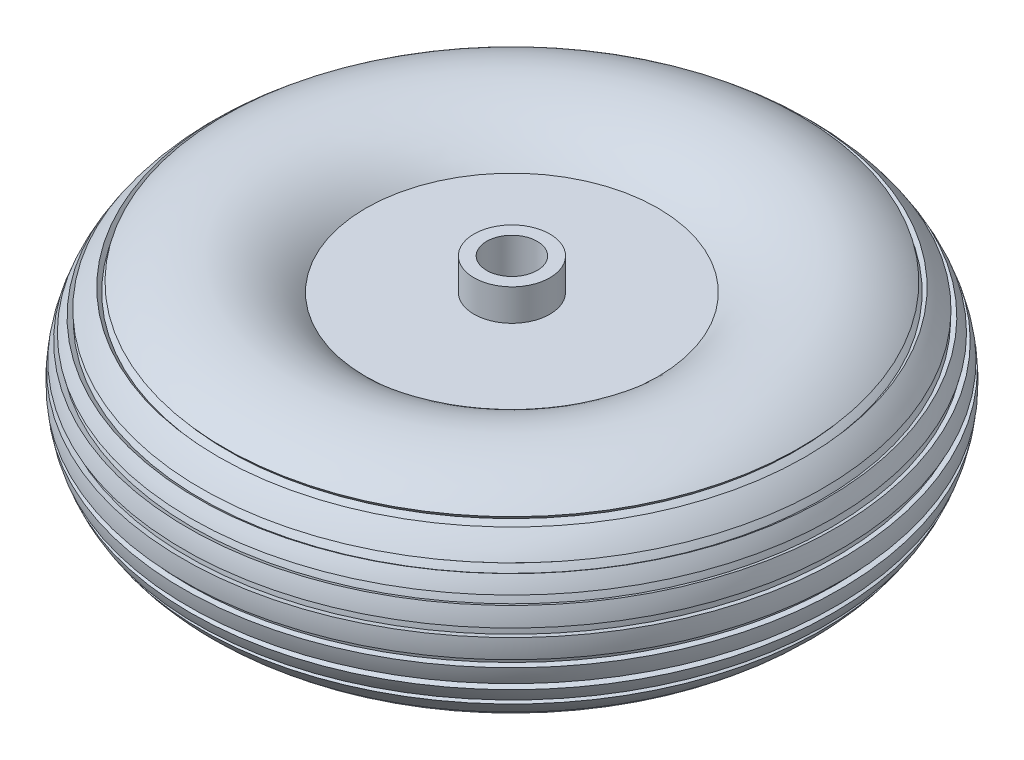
ISO-10303-21;
HEADER;
FILE_DESCRIPTION(('STEP AP214'),'2;1');
FILE_NAME('part.step','',(''),(''),'','','');
FILE_SCHEMA(('AUTOMOTIVE_DESIGN { 1 0 10303 214 1 1 1 1 }'));
ENDSEC;
DATA;
#1=APPLICATION_CONTEXT('core data for automotive mechanical design processes');
#2=APPLICATION_PROTOCOL_DEFINITION('international standard','automotive_design',2000,#1);
#3=PRODUCT_CONTEXT('',#1,'mechanical');
#4=PRODUCT('Part','Part','',(#3));
#5=PRODUCT_RELATED_PRODUCT_CATEGORY('part','',(#4));
#6=PRODUCT_DEFINITION_FORMATION('','',#4);
#7=PRODUCT_DEFINITION_CONTEXT('part definition',#1,'design');
#8=PRODUCT_DEFINITION('design','',#6,#7);
#9=PRODUCT_DEFINITION_SHAPE('','',#8);
#10=(LENGTH_UNIT() NAMED_UNIT(*) SI_UNIT(.MILLI.,.METRE.));
#11=(NAMED_UNIT(*) PLANE_ANGLE_UNIT() SI_UNIT($,.RADIAN.));
#12=(NAMED_UNIT(*) SI_UNIT($,.STERADIAN.) SOLID_ANGLE_UNIT());
#13=UNCERTAINTY_MEASURE_WITH_UNIT(LENGTH_MEASURE(1.E-05),#10,'distance_accuracy_value','');
#14=(GEOMETRIC_REPRESENTATION_CONTEXT(3) GLOBAL_UNCERTAINTY_ASSIGNED_CONTEXT((#13)) GLOBAL_UNIT_ASSIGNED_CONTEXT((#10,
#11,#12)) REPRESENTATION_CONTEXT('',''));
#15=CARTESIAN_POINT('',(0.,0.,0.));
#16=DIRECTION('',(0.,0.,1.));
#17=DIRECTION('',(1.,0.,0.));
#18=AXIS2_PLACEMENT_3D('',#15,#16,#17);
#19=CARTESIAN_POINT('',(0.,30.,0.));
#20=DIRECTION('',(0.,1.,0.));
#21=DIRECTION('',(0.,0.,1.));
#22=AXIS2_PLACEMENT_3D('',#19,#20,#21);
#23=PLANE('',#22);
#24=CARTESIAN_POINT('',(0.,30.,-65.1760171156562));
#25=DIRECTION('',(0.,-1.,0.));
#26=DIRECTION('',(0.,0.,-1.));
#27=AXIS2_PLACEMENT_3D('',#24,#25,#26);
#28=CIRCLE('',#27,57.7480477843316);
#29=CARTESIAN_POINT('',(0.,30.,-122.924064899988));
#30=VERTEX_POINT('',#29);
#31=EDGE_CURVE('E177',#30,#30,#28,.T.);
#32=ORIENTED_EDGE('',*,*,#31,.F.);
#33=EDGE_LOOP('',(#32));
#34=FACE_BOUND('',#33,.T.);
#35=CARTESIAN_POINT('',(0.,30.,-65.1760171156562));
#36=DIRECTION('',(0.,1.,0.));
#37=DIRECTION('',(0.,0.,1.));
#38=AXIS2_PLACEMENT_3D('',#35,#36,#37);
#39=CIRCLE('',#38,15.);
#40=CARTESIAN_POINT('',(0.,30.,-50.1760171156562));
#41=VERTEX_POINT('',#40);
#42=EDGE_CURVE('E202',#41,#41,#39,.T.);
#43=ORIENTED_EDGE('',*,*,#42,.F.);
#44=EDGE_LOOP('',(#43));
#45=FACE_BOUND('',#44,.T.);
#46=ADVANCED_FACE('F45',(#34,#45),#23,.T.);
#47=CARTESIAN_POINT('',(0.,-30.,0.));
#48=DIRECTION('',(0.,1.,0.));
#49=DIRECTION('',(0.,0.,1.));
#50=AXIS2_PLACEMENT_3D('',#47,#48,#49);
#51=PLANE('',#50);
#52=CARTESIAN_POINT('',(0.,-30.,-65.1760171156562));
#53=DIRECTION('',(0.,-1.,0.));
#54=DIRECTION('',(0.,0.,-1.));
#55=AXIS2_PLACEMENT_3D('',#52,#53,#54);
#56=CIRCLE('',#55,57.7480477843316);
#57=CARTESIAN_POINT('',(0.,-30.,-122.924064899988));
#58=VERTEX_POINT('',#57);
#59=EDGE_CURVE('E173',#58,#58,#56,.T.);
#60=ORIENTED_EDGE('',*,*,#59,.T.);
#61=EDGE_LOOP('',(#60));
#62=FACE_BOUND('',#61,.T.);
#63=CARTESIAN_POINT('',(0.,-30.,-65.1760171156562));
#64=DIRECTION('',(0.,1.,0.));
#65=DIRECTION('',(0.,0.,1.));
#66=AXIS2_PLACEMENT_3D('',#63,#64,#65);
#67=CIRCLE('',#66,15.);
#68=CARTESIAN_POINT('',(0.,-30.,-50.1760171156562));
#69=VERTEX_POINT('',#68);
#70=EDGE_CURVE('E10',#69,#69,#67,.F.);
#71=ORIENTED_EDGE('',*,*,#70,.F.);
#72=EDGE_LOOP('',(#71));
#73=FACE_BOUND('',#72,.T.);
#74=ADVANCED_FACE('F233',(#62,#73),#51,.F.);
#75=CARTESIAN_POINT('',(0.,30.1684176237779,-65.1760171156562));
#76=DIRECTION('',(0.,1.,0.));
#77=DIRECTION('',(0.,0.,1.));
#78=AXIS2_PLACEMENT_3D('',#75,#76,#77);
#79=CONICAL_SURFACE('',#78,114.733442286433,0.727845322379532);
#80=CARTESIAN_POINT('',(0.,31.7309063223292,-65.1760171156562));
#81=DIRECTION('',(0.,-1.,0.));
#82=DIRECTION('',(0.,0.,-1.));
#83=AXIS2_PLACEMENT_3D('',#80,#81,#82);
#84=CIRCLE('',#83,116.125689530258);
#85=CARTESIAN_POINT('',(0.,31.7309063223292,-181.301706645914));
#86=VERTEX_POINT('',#85);
#87=EDGE_CURVE('E53',#86,#86,#84,.T.);
#88=ORIENTED_EDGE('',*,*,#87,.F.);
#89=EDGE_LOOP('',(#88));
#90=FACE_BOUND('',#89,.T.);
#91=CARTESIAN_POINT('',(0.,30.1684176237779,-65.1760171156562));
#92=DIRECTION('',(0.,-1.,0.));
#93=DIRECTION('',(0.,0.,-1.));
#94=AXIS2_PLACEMENT_3D('',#91,#92,#93);
#95=CIRCLE('',#94,114.733442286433);
#96=CARTESIAN_POINT('',(0.,30.1684176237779,-179.909459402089));
#97=VERTEX_POINT('',#96);
#98=EDGE_CURVE('E189',#97,#97,#95,.T.);
#99=ORIENTED_EDGE('',*,*,#98,.T.);
#100=EDGE_LOOP('',(#99));
#101=FACE_BOUND('',#100,.T.);
#102=ADVANCED_FACE('F47',(#90,#101),#79,.F.);
#103=CARTESIAN_POINT('',(0.,0.,-65.1760171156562));
#104=DIRECTION('',(0.,-1.,0.));
#105=DIRECTION('',(0.,0.,-1.));
#106=AXIS2_PLACEMENT_3D('',#103,#104,#105);
#107=TOROIDAL_SURFACE('',#106,87.8520342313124,42.5);
#108=CARTESIAN_POINT('',(0.,24.1701646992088,-65.1760171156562));
#109=DIRECTION('',(0.,-1.,0.));
#110=DIRECTION('',(0.,0.,-1.));
#111=AXIS2_PLACEMENT_3D('',#108,#109,#110);
#112=CIRCLE('',#111,122.80991086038);
#113=CARTESIAN_POINT('',(0.,24.1701646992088,-187.985927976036));
#114=VERTEX_POINT('',#113);
#115=EDGE_CURVE('E58',#114,#114,#112,.T.);
#116=ORIENTED_EDGE('',*,*,#115,.F.);
#117=EDGE_LOOP('',(#116));
#118=FACE_BOUND('',#117,.T.);
#119=ORIENTED_EDGE('',*,*,#87,.T.);
#120=EDGE_LOOP('',(#119));
#121=FACE_BOUND('',#120,.T.);
#122=ADVANCED_FACE('F359',(#118,#121),#107,.T.);
#123=CARTESIAN_POINT('',(0.,22.9799809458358,-65.1760171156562));
#124=DIRECTION('',(0.,1.,0.));
#125=DIRECTION('',(0.,0.,1.));
#126=AXIS2_PLACEMENT_3D('',#123,#124,#125);
#127=CONICAL_SURFACE('',#126,121.088520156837,0.965859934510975);
#128=ORIENTED_EDGE('',*,*,#115,.T.);
#129=EDGE_LOOP('',(#128));
#130=FACE_BOUND('',#129,.T.);
#131=CARTESIAN_POINT('',(0.,22.9799809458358,-65.1760171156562));
#132=DIRECTION('',(0.,-1.,0.));
#133=DIRECTION('',(0.,0.,-1.));
#134=AXIS2_PLACEMENT_3D('',#131,#132,#133);
#135=CIRCLE('',#134,121.088520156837);
#136=CARTESIAN_POINT('',(0.,22.9799809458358,-186.264537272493));
#137=VERTEX_POINT('',#136);
#138=EDGE_CURVE('E63',#137,#137,#135,.T.);
#139=ORIENTED_EDGE('',*,*,#138,.F.);
#140=EDGE_LOOP('',(#139));
#141=FACE_BOUND('',#140,.T.);
#142=ADVANCED_FACE('F356',(#130,#141),#127,.T.);
#143=CARTESIAN_POINT('',(0.,0.,-65.1760171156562));
#144=DIRECTION('',(0.,-1.,0.));
#145=DIRECTION('',(0.,0.,-1.));
#146=AXIS2_PLACEMENT_3D('',#143,#144,#145);
#147=TOROIDAL_SURFACE('',#146,87.8520342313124,40.407221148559);
#148=CARTESIAN_POINT('',(0.,20.4806485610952,-65.1760171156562));
#149=DIRECTION('',(0.,-1.,0.));
#150=DIRECTION('',(0.,0.,-1.));
#151=AXIS2_PLACEMENT_3D('',#148,#149,#150);
#152=CIRCLE('',#151,122.684297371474);
#153=CARTESIAN_POINT('',(0.,20.4806485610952,-187.86031448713));
#154=VERTEX_POINT('',#153);
#155=EDGE_CURVE('E69',#154,#154,#152,.T.);
#156=ORIENTED_EDGE('',*,*,#155,.F.);
#157=EDGE_LOOP('',(#156));
#158=FACE_BOUND('',#157,.T.);
#159=ORIENTED_EDGE('',*,*,#138,.T.);
#160=EDGE_LOOP('',(#159));
#161=FACE_BOUND('',#160,.T.);
#162=ADVANCED_FACE('F352',(#158,#161),#147,.T.);
#163=CARTESIAN_POINT('',(0.,21.6438709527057,-65.1760171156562));
#164=DIRECTION('',(0.,1.,0.));
#165=DIRECTION('',(0.,0.,1.));
#166=AXIS2_PLACEMENT_3D('',#163,#164,#165);
#167=CONICAL_SURFACE('',#166,124.427884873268,0.982463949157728);
#168=ORIENTED_EDGE('',*,*,#155,.T.);
#169=EDGE_LOOP('',(#168));
#170=FACE_BOUND('',#169,.T.);
#171=CARTESIAN_POINT('',(0.,21.6438709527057,-65.1760171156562));
#172=DIRECTION('',(0.,-1.,0.));
#173=DIRECTION('',(0.,0.,-1.));
#174=AXIS2_PLACEMENT_3D('',#171,#172,#173);
#175=CIRCLE('',#174,124.427884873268);
#176=CARTESIAN_POINT('',(0.,21.6438709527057,-189.603901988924));
#177=VERTEX_POINT('',#176);
#178=EDGE_CURVE('E73',#177,#177,#175,.T.);
#179=ORIENTED_EDGE('',*,*,#178,.F.);
#180=EDGE_LOOP('',(#179));
#181=FACE_BOUND('',#180,.T.);
#182=ADVANCED_FACE('F348',(#170,#181),#167,.F.);
#183=CARTESIAN_POINT('',(0.,0.,-65.1760171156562));
#184=DIRECTION('',(0.,-1.,0.));
#185=DIRECTION('',(0.,0.,-1.));
#186=AXIS2_PLACEMENT_3D('',#183,#184,#185);
#187=TOROIDAL_SURFACE('',#186,87.8520342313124,42.5);
#188=CARTESIAN_POINT('',(0.,16.204262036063,-65.1760171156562));
#189=DIRECTION('',(0.,-1.,0.));
#190=DIRECTION('',(0.,0.,-1.));
#191=AXIS2_PLACEMENT_3D('',#188,#189,#190);
#192=CIRCLE('',#191,127.141624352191);
#193=CARTESIAN_POINT('',(0.,16.204262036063,-192.317641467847));
#194=VERTEX_POINT('',#193);
#195=EDGE_CURVE('E77',#194,#194,#192,.T.);
#196=ORIENTED_EDGE('',*,*,#195,.F.);
#197=EDGE_LOOP('',(#196));
#198=FACE_BOUND('',#197,.T.);
#199=ORIENTED_EDGE('',*,*,#178,.T.);
#200=EDGE_LOOP('',(#199));
#201=FACE_BOUND('',#200,.T.);
#202=ADVANCED_FACE('F344',(#198,#201),#187,.T.);
#203=CARTESIAN_POINT('',(0.,15.4063341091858,-65.1760171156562));
#204=DIRECTION('',(0.,1.,0.));
#205=DIRECTION('',(0.,0.,1.));
#206=AXIS2_PLACEMENT_3D('',#203,#204,#205);
#207=CONICAL_SURFACE('',#206,125.206932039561,1.17961934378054);
#208=ORIENTED_EDGE('',*,*,#195,.T.);
#209=EDGE_LOOP('',(#208));
#210=FACE_BOUND('',#209,.T.);
#211=CARTESIAN_POINT('',(0.,15.4063341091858,-65.1760171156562));
#212=DIRECTION('',(0.,-1.,0.));
#213=DIRECTION('',(0.,0.,-1.));
#214=AXIS2_PLACEMENT_3D('',#211,#212,#213);
#215=CIRCLE('',#214,125.206932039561);
#216=CARTESIAN_POINT('',(0.,15.4063341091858,-190.382949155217));
#217=VERTEX_POINT('',#216);
#218=EDGE_CURVE('E81',#217,#217,#215,.T.);
#219=ORIENTED_EDGE('',*,*,#218,.F.);
#220=EDGE_LOOP('',(#219));
#221=FACE_BOUND('',#220,.T.);
#222=ADVANCED_FACE('F340',(#210,#221),#207,.T.);
#223=CARTESIAN_POINT('',(0.,0.,-65.1760171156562));
#224=DIRECTION('',(0.,-1.,0.));
#225=DIRECTION('',(0.,0.,-1.));
#226=AXIS2_PLACEMENT_3D('',#223,#224,#225);
#227=TOROIDAL_SURFACE('',#226,87.8520342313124,40.407221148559);
#228=CARTESIAN_POINT('',(0.,12.592212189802,-65.1760171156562));
#229=DIRECTION('',(0.,-1.,0.));
#230=DIRECTION('',(0.,0.,-1.));
#231=AXIS2_PLACEMENT_3D('',#228,#229,#230);
#232=CIRCLE('',#231,126.247082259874);
#233=CARTESIAN_POINT('',(0.,12.592212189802,-191.42309937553));
#234=VERTEX_POINT('',#233);
#235=EDGE_CURVE('E85',#234,#234,#232,.T.);
#236=ORIENTED_EDGE('',*,*,#235,.F.);
#237=EDGE_LOOP('',(#236));
#238=FACE_BOUND('',#237,.T.);
#239=ORIENTED_EDGE('',*,*,#218,.T.);
#240=EDGE_LOOP('',(#239));
#241=FACE_BOUND('',#240,.T.);
#242=ADVANCED_FACE('F336',(#238,#241),#227,.T.);
#243=CARTESIAN_POINT('',(0.,13.3922366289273,-65.1760171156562));
#244=DIRECTION('',(0.,1.,0.));
#245=DIRECTION('',(0.,0.,1.));
#246=AXIS2_PLACEMENT_3D('',#243,#244,#245);
#247=CONICAL_SURFACE('',#246,128.186857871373,1.1796193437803);
#248=ORIENTED_EDGE('',*,*,#235,.T.);
#249=EDGE_LOOP('',(#248));
#250=FACE_BOUND('',#249,.T.);
#251=CARTESIAN_POINT('',(0.,13.3922366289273,-65.1760171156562));
#252=DIRECTION('',(0.,-1.,0.));
#253=DIRECTION('',(0.,0.,-1.));
#254=AXIS2_PLACEMENT_3D('',#251,#252,#253);
#255=CIRCLE('',#254,128.186857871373);
#256=CARTESIAN_POINT('',(0.,13.3922366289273,-193.362874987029));
#257=VERTEX_POINT('',#256);
#258=EDGE_CURVE('E89',#257,#257,#255,.T.);
#259=ORIENTED_EDGE('',*,*,#258,.F.);
#260=EDGE_LOOP('',(#259));
#261=FACE_BOUND('',#260,.T.);
#262=ADVANCED_FACE('F332',(#250,#261),#247,.F.);
#263=CARTESIAN_POINT('',(0.,0.,-65.1760171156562));
#264=DIRECTION('',(0.,-1.,0.));
#265=DIRECTION('',(0.,0.,-1.));
#266=AXIS2_PLACEMENT_3D('',#263,#264,#265);
#267=TOROIDAL_SURFACE('',#266,87.8520342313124,42.5);
#268=CARTESIAN_POINT('',(0.,6.79895962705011,-65.1760171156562));
#269=DIRECTION('',(0.,-1.,0.));
#270=DIRECTION('',(0.,0.,-1.));
#271=AXIS2_PLACEMENT_3D('',#268,#269,#270);
#272=CIRCLE('',#271,129.804675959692);
#273=CARTESIAN_POINT('',(0.,6.79895962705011,-194.980693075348));
#274=VERTEX_POINT('',#273);
#275=EDGE_CURVE('E93',#274,#274,#272,.T.);
#276=ORIENTED_EDGE('',*,*,#275,.F.);
#277=EDGE_LOOP('',(#276));
#278=FACE_BOUND('',#277,.T.);
#279=ORIENTED_EDGE('',*,*,#258,.T.);
#280=EDGE_LOOP('',(#279));
#281=FACE_BOUND('',#280,.T.);
#282=ADVANCED_FACE('F328',(#278,#281),#267,.T.);
#283=CARTESIAN_POINT('',(0.,6.46416624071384,-65.1760171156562));
#284=DIRECTION('',(0.,1.,0.));
#285=DIRECTION('',(0.,0.,1.));
#286=AXIS2_PLACEMENT_3D('',#283,#284,#285);
#287=CONICAL_SURFACE('',#286,127.738850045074,1.41013047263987);
#288=ORIENTED_EDGE('',*,*,#275,.T.);
#289=EDGE_LOOP('',(#288));
#290=FACE_BOUND('',#289,.T.);
#291=CARTESIAN_POINT('',(0.,6.46416624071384,-65.1760171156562));
#292=DIRECTION('',(0.,-1.,0.));
#293=DIRECTION('',(0.,0.,-1.));
#294=AXIS2_PLACEMENT_3D('',#291,#292,#293);
#295=CIRCLE('',#294,127.738850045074);
#296=CARTESIAN_POINT('',(0.,6.46416624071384,-192.91486716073));
#297=VERTEX_POINT('',#296);
#298=EDGE_CURVE('E97',#297,#297,#295,.T.);
#299=ORIENTED_EDGE('',*,*,#298,.F.);
#300=EDGE_LOOP('',(#299));
#301=FACE_BOUND('',#300,.T.);
#302=ADVANCED_FACE('F324',(#290,#301),#287,.T.);
#303=CARTESIAN_POINT('',(0.,0.,-65.1760171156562));
#304=DIRECTION('',(0.,-1.,0.));
#305=DIRECTION('',(0.,0.,-1.));
#306=AXIS2_PLACEMENT_3D('',#303,#304,#305);
#307=TOROIDAL_SURFACE('',#306,87.8520342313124,40.407221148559);
#308=CARTESIAN_POINT('',(0.,3.46797674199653,-65.1760171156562));
#309=DIRECTION('',(0.,-1.,0.));
#310=DIRECTION('',(0.,0.,-1.));
#311=AXIS2_PLACEMENT_3D('',#308,#309,#310);
#312=CIRCLE('',#311,128.110159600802);
#313=CARTESIAN_POINT('',(0.,3.46797674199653,-193.286176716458));
#314=VERTEX_POINT('',#313);
#315=EDGE_CURVE('E101',#314,#314,#312,.T.);
#316=ORIENTED_EDGE('',*,*,#315,.F.);
#317=EDGE_LOOP('',(#316));
#318=FACE_BOUND('',#317,.T.);
#319=ORIENTED_EDGE('',*,*,#298,.T.);
#320=EDGE_LOOP('',(#319));
#321=FACE_BOUND('',#320,.T.);
#322=ADVANCED_FACE('F320',(#318,#321),#307,.T.);
#323=CARTESIAN_POINT('',(0.,3.79895962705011,-65.1760171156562));
#324=DIRECTION('',(0.,1.,0.));
#325=DIRECTION('',(0.,0.,1.));
#326=AXIS2_PLACEMENT_3D('',#323,#324,#325);
#327=CONICAL_SURFACE('',#326,130.181904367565,1.41237463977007);
#328=ORIENTED_EDGE('',*,*,#315,.T.);
#329=EDGE_LOOP('',(#328));
#330=FACE_BOUND('',#329,.T.);
#331=CARTESIAN_POINT('',(0.,3.79895962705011,-65.1760171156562));
#332=DIRECTION('',(0.,-1.,0.));
#333=DIRECTION('',(0.,0.,-1.));
#334=AXIS2_PLACEMENT_3D('',#331,#332,#333);
#335=CIRCLE('',#334,130.181904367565);
#336=CARTESIAN_POINT('',(0.,3.79895962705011,-195.357921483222));
#337=VERTEX_POINT('',#336);
#338=EDGE_CURVE('E105',#337,#337,#335,.T.);
#339=ORIENTED_EDGE('',*,*,#338,.F.);
#340=EDGE_LOOP('',(#339));
#341=FACE_BOUND('',#340,.T.);
#342=ADVANCED_FACE('F316',(#330,#341),#327,.F.);
#343=CARTESIAN_POINT('',(0.,0.,-65.1760171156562));
#344=DIRECTION('',(0.,-1.,0.));
#345=DIRECTION('',(0.,0.,-1.));
#346=AXIS2_PLACEMENT_3D('',#343,#344,#345);
#347=TOROIDAL_SURFACE('',#346,87.8520342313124,42.5);
#348=CARTESIAN_POINT('',(0.,-3.79895962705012,-65.1760171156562));
#349=DIRECTION('',(0.,-1.,0.));
#350=DIRECTION('',(0.,0.,-1.));
#351=AXIS2_PLACEMENT_3D('',#348,#349,#350);
#352=CIRCLE('',#351,130.181904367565);
#353=CARTESIAN_POINT('',(0.,-3.79895962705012,-195.357921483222));
#354=VERTEX_POINT('',#353);
#355=EDGE_CURVE('E109',#354,#354,#352,.T.);
#356=ORIENTED_EDGE('',*,*,#355,.F.);
#357=EDGE_LOOP('',(#356));
#358=FACE_BOUND('',#357,.T.);
#359=ORIENTED_EDGE('',*,*,#338,.T.);
#360=EDGE_LOOP('',(#359));
#361=FACE_BOUND('',#360,.T.);
#362=ADVANCED_FACE('F312',(#358,#361),#347,.T.);
#363=CARTESIAN_POINT('',(0.,-3.79895962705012,-65.1760171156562));
#364=DIRECTION('',(0.,-1.,0.));
#365=DIRECTION('',(0.,0.,-1.));
#366=AXIS2_PLACEMENT_3D('',#363,#364,#365);
#367=CONICAL_SURFACE('',#366,130.181904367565,1.41237463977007);
#368=CARTESIAN_POINT('',(0.,-3.46797674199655,-65.1760171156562));
#369=DIRECTION('',(0.,-1.,0.));
#370=DIRECTION('',(0.,0.,-1.));
#371=AXIS2_PLACEMENT_3D('',#368,#369,#370);
#372=CIRCLE('',#371,128.110159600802);
#373=CARTESIAN_POINT('',(0.,-3.46797674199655,-193.286176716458));
#374=VERTEX_POINT('',#373);
#375=EDGE_CURVE('E113',#374,#374,#372,.T.);
#376=ORIENTED_EDGE('',*,*,#375,.F.);
#377=EDGE_LOOP('',(#376));
#378=FACE_BOUND('',#377,.T.);
#379=ORIENTED_EDGE('',*,*,#355,.T.);
#380=EDGE_LOOP('',(#379));
#381=FACE_BOUND('',#380,.T.);
#382=ADVANCED_FACE('F308',(#378,#381),#367,.F.);
#383=CARTESIAN_POINT('',(0.,0.,-65.1760171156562));
#384=DIRECTION('',(0.,-1.,0.));
#385=DIRECTION('',(0.,0.,-1.));
#386=AXIS2_PLACEMENT_3D('',#383,#384,#385);
#387=TOROIDAL_SURFACE('',#386,87.8520342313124,40.407221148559);
#388=ORIENTED_EDGE('',*,*,#375,.T.);
#389=EDGE_LOOP('',(#388));
#390=FACE_BOUND('',#389,.T.);
#391=CARTESIAN_POINT('',(0.,-6.46416624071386,-65.1760171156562));
#392=DIRECTION('',(0.,-1.,0.));
#393=DIRECTION('',(0.,0.,-1.));
#394=AXIS2_PLACEMENT_3D('',#391,#392,#393);
#395=CIRCLE('',#394,127.738850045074);
#396=CARTESIAN_POINT('',(0.,-6.46416624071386,-192.91486716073));
#397=VERTEX_POINT('',#396);
#398=EDGE_CURVE('E117',#397,#397,#395,.T.);
#399=ORIENTED_EDGE('',*,*,#398,.F.);
#400=EDGE_LOOP('',(#399));
#401=FACE_BOUND('',#400,.T.);
#402=ADVANCED_FACE('F304',(#390,#401),#387,.T.);
#403=CARTESIAN_POINT('',(0.,-6.46416624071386,-65.1760171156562));
#404=DIRECTION('',(0.,-1.,0.));
#405=DIRECTION('',(0.,0.,-1.));
#406=AXIS2_PLACEMENT_3D('',#403,#404,#405);
#407=CONICAL_SURFACE('',#406,127.738850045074,1.41013047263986);
#408=CARTESIAN_POINT('',(0.,-6.79895962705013,-65.1760171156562));
#409=DIRECTION('',(0.,-1.,0.));
#410=DIRECTION('',(0.,0.,-1.));
#411=AXIS2_PLACEMENT_3D('',#408,#409,#410);
#412=CIRCLE('',#411,129.804675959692);
#413=CARTESIAN_POINT('',(0.,-6.79895962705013,-194.980693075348));
#414=VERTEX_POINT('',#413);
#415=EDGE_CURVE('E121',#414,#414,#412,.T.);
#416=ORIENTED_EDGE('',*,*,#415,.F.);
#417=EDGE_LOOP('',(#416));
#418=FACE_BOUND('',#417,.T.);
#419=ORIENTED_EDGE('',*,*,#398,.T.);
#420=EDGE_LOOP('',(#419));
#421=FACE_BOUND('',#420,.T.);
#422=ADVANCED_FACE('F300',(#418,#421),#407,.T.);
#423=CARTESIAN_POINT('',(0.,0.,-65.1760171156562));
#424=DIRECTION('',(0.,-1.,0.));
#425=DIRECTION('',(0.,0.,-1.));
#426=AXIS2_PLACEMENT_3D('',#423,#424,#425);
#427=TOROIDAL_SURFACE('',#426,87.8520342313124,42.5);
#428=CARTESIAN_POINT('',(0.,-13.3922366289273,-65.1760171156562));
#429=DIRECTION('',(0.,-1.,0.));
#430=DIRECTION('',(0.,0.,-1.));
#431=AXIS2_PLACEMENT_3D('',#428,#429,#430);
#432=CIRCLE('',#431,128.186857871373);
#433=CARTESIAN_POINT('',(0.,-13.3922366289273,-193.362874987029));
#434=VERTEX_POINT('',#433);
#435=EDGE_CURVE('E125',#434,#434,#432,.T.);
#436=ORIENTED_EDGE('',*,*,#435,.F.);
#437=EDGE_LOOP('',(#436));
#438=FACE_BOUND('',#437,.T.);
#439=ORIENTED_EDGE('',*,*,#415,.T.);
#440=EDGE_LOOP('',(#439));
#441=FACE_BOUND('',#440,.T.);
#442=ADVANCED_FACE('F296',(#438,#441),#427,.T.);
#443=CARTESIAN_POINT('',(0.,-13.3922366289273,-65.1760171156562));
#444=DIRECTION('',(0.,-1.,0.));
#445=DIRECTION('',(0.,0.,-1.));
#446=AXIS2_PLACEMENT_3D('',#443,#444,#445);
#447=CONICAL_SURFACE('',#446,128.186857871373,1.17961934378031);
#448=CARTESIAN_POINT('',(0.,-12.592212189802,-65.1760171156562));
#449=DIRECTION('',(0.,-1.,0.));
#450=DIRECTION('',(0.,0.,-1.));
#451=AXIS2_PLACEMENT_3D('',#448,#449,#450);
#452=CIRCLE('',#451,126.247082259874);
#453=CARTESIAN_POINT('',(0.,-12.592212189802,-191.42309937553));
#454=VERTEX_POINT('',#453);
#455=EDGE_CURVE('E129',#454,#454,#452,.T.);
#456=ORIENTED_EDGE('',*,*,#455,.F.);
#457=EDGE_LOOP('',(#456));
#458=FACE_BOUND('',#457,.T.);
#459=ORIENTED_EDGE('',*,*,#435,.T.);
#460=EDGE_LOOP('',(#459));
#461=FACE_BOUND('',#460,.T.);
#462=ADVANCED_FACE('F292',(#458,#461),#447,.F.);
#463=CARTESIAN_POINT('',(0.,0.,-65.1760171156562));
#464=DIRECTION('',(0.,-1.,0.));
#465=DIRECTION('',(0.,0.,-1.));
#466=AXIS2_PLACEMENT_3D('',#463,#464,#465);
#467=TOROIDAL_SURFACE('',#466,87.8520342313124,40.407221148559);
#468=ORIENTED_EDGE('',*,*,#455,.T.);
#469=EDGE_LOOP('',(#468));
#470=FACE_BOUND('',#469,.T.);
#471=CARTESIAN_POINT('',(0.,-15.4063341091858,-65.1760171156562));
#472=DIRECTION('',(0.,-1.,0.));
#473=DIRECTION('',(0.,0.,-1.));
#474=AXIS2_PLACEMENT_3D('',#471,#472,#473);
#475=CIRCLE('',#474,125.206932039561);
#476=CARTESIAN_POINT('',(0.,-15.4063341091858,-190.382949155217));
#477=VERTEX_POINT('',#476);
#478=EDGE_CURVE('E133',#477,#477,#475,.T.);
#479=ORIENTED_EDGE('',*,*,#478,.F.);
#480=EDGE_LOOP('',(#479));
#481=FACE_BOUND('',#480,.T.);
#482=ADVANCED_FACE('F288',(#470,#481),#467,.T.);
#483=CARTESIAN_POINT('',(0.,-15.4063341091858,-65.1760171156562));
#484=DIRECTION('',(0.,-1.,0.));
#485=DIRECTION('',(0.,0.,-1.));
#486=AXIS2_PLACEMENT_3D('',#483,#484,#485);
#487=CONICAL_SURFACE('',#486,125.206932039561,1.17961934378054);
#488=CARTESIAN_POINT('',(0.,-16.204262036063,-65.1760171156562));
#489=DIRECTION('',(0.,-1.,0.));
#490=DIRECTION('',(0.,0.,-1.));
#491=AXIS2_PLACEMENT_3D('',#488,#489,#490);
#492=CIRCLE('',#491,127.141624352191);
#493=CARTESIAN_POINT('',(0.,-16.204262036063,-192.317641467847));
#494=VERTEX_POINT('',#493);
#495=EDGE_CURVE('E137',#494,#494,#492,.T.);
#496=ORIENTED_EDGE('',*,*,#495,.F.);
#497=EDGE_LOOP('',(#496));
#498=FACE_BOUND('',#497,.T.);
#499=ORIENTED_EDGE('',*,*,#478,.T.);
#500=EDGE_LOOP('',(#499));
#501=FACE_BOUND('',#500,.T.);
#502=ADVANCED_FACE('F284',(#498,#501),#487,.T.);
#503=CARTESIAN_POINT('',(0.,0.,-65.1760171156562));
#504=DIRECTION('',(0.,-1.,0.));
#505=DIRECTION('',(0.,0.,-1.));
#506=AXIS2_PLACEMENT_3D('',#503,#504,#505);
#507=TOROIDAL_SURFACE('',#506,87.8520342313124,42.5);
#508=CARTESIAN_POINT('',(0.,-21.6438709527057,-65.1760171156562));
#509=DIRECTION('',(0.,-1.,0.));
#510=DIRECTION('',(0.,0.,-1.));
#511=AXIS2_PLACEMENT_3D('',#508,#509,#510);
#512=CIRCLE('',#511,124.427884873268);
#513=CARTESIAN_POINT('',(0.,-21.6438709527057,-189.603901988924));
#514=VERTEX_POINT('',#513);
#515=EDGE_CURVE('E141',#514,#514,#512,.T.);
#516=ORIENTED_EDGE('',*,*,#515,.F.);
#517=EDGE_LOOP('',(#516));
#518=FACE_BOUND('',#517,.T.);
#519=ORIENTED_EDGE('',*,*,#495,.T.);
#520=EDGE_LOOP('',(#519));
#521=FACE_BOUND('',#520,.T.);
#522=ADVANCED_FACE('F280',(#518,#521),#507,.T.);
#523=CARTESIAN_POINT('',(0.,-21.6438709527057,-65.1760171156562));
#524=DIRECTION('',(0.,-1.,0.));
#525=DIRECTION('',(0.,0.,-1.));
#526=AXIS2_PLACEMENT_3D('',#523,#524,#525);
#527=CONICAL_SURFACE('',#526,124.427884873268,0.982463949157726);
#528=CARTESIAN_POINT('',(0.,-20.4806485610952,-65.1760171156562));
#529=DIRECTION('',(0.,-1.,0.));
#530=DIRECTION('',(0.,0.,-1.));
#531=AXIS2_PLACEMENT_3D('',#528,#529,#530);
#532=CIRCLE('',#531,122.684297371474);
#533=CARTESIAN_POINT('',(0.,-20.4806485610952,-187.86031448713));
#534=VERTEX_POINT('',#533);
#535=EDGE_CURVE('E145',#534,#534,#532,.T.);
#536=ORIENTED_EDGE('',*,*,#535,.F.);
#537=EDGE_LOOP('',(#536));
#538=FACE_BOUND('',#537,.T.);
#539=ORIENTED_EDGE('',*,*,#515,.T.);
#540=EDGE_LOOP('',(#539));
#541=FACE_BOUND('',#540,.T.);
#542=ADVANCED_FACE('F276',(#538,#541),#527,.F.);
#543=CARTESIAN_POINT('',(0.,0.,-65.1760171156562));
#544=DIRECTION('',(0.,-1.,0.));
#545=DIRECTION('',(0.,0.,-1.));
#546=AXIS2_PLACEMENT_3D('',#543,#544,#545);
#547=TOROIDAL_SURFACE('',#546,87.8520342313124,40.407221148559);
#548=ORIENTED_EDGE('',*,*,#535,.T.);
#549=EDGE_LOOP('',(#548));
#550=FACE_BOUND('',#549,.T.);
#551=CARTESIAN_POINT('',(0.,-22.9799809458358,-65.1760171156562));
#552=DIRECTION('',(0.,-1.,0.));
#553=DIRECTION('',(0.,0.,-1.));
#554=AXIS2_PLACEMENT_3D('',#551,#552,#553);
#555=CIRCLE('',#554,121.088520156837);
#556=CARTESIAN_POINT('',(0.,-22.9799809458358,-186.264537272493));
#557=VERTEX_POINT('',#556);
#558=EDGE_CURVE('E149',#557,#557,#555,.T.);
#559=ORIENTED_EDGE('',*,*,#558,.F.);
#560=EDGE_LOOP('',(#559));
#561=FACE_BOUND('',#560,.T.);
#562=ADVANCED_FACE('F272',(#550,#561),#547,.T.);
#563=CARTESIAN_POINT('',(0.,-22.9799809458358,-65.1760171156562));
#564=DIRECTION('',(0.,-1.,0.));
#565=DIRECTION('',(0.,0.,-1.));
#566=AXIS2_PLACEMENT_3D('',#563,#564,#565);
#567=CONICAL_SURFACE('',#566,121.088520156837,0.965859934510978);
#568=CARTESIAN_POINT('',(0.,-24.1701646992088,-65.1760171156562));
#569=DIRECTION('',(0.,-1.,0.));
#570=DIRECTION('',(0.,0.,-1.));
#571=AXIS2_PLACEMENT_3D('',#568,#569,#570);
#572=CIRCLE('',#571,122.80991086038);
#573=CARTESIAN_POINT('',(0.,-24.1701646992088,-187.985927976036));
#574=VERTEX_POINT('',#573);
#575=EDGE_CURVE('E153',#574,#574,#572,.T.);
#576=ORIENTED_EDGE('',*,*,#575,.F.);
#577=EDGE_LOOP('',(#576));
#578=FACE_BOUND('',#577,.T.);
#579=ORIENTED_EDGE('',*,*,#558,.T.);
#580=EDGE_LOOP('',(#579));
#581=FACE_BOUND('',#580,.T.);
#582=ADVANCED_FACE('F268',(#578,#581),#567,.T.);
#583=CARTESIAN_POINT('',(0.,0.,-65.1760171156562));
#584=DIRECTION('',(0.,-1.,0.));
#585=DIRECTION('',(0.,0.,-1.));
#586=AXIS2_PLACEMENT_3D('',#583,#584,#585);
#587=TOROIDAL_SURFACE('',#586,87.8520342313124,42.5);
#588=CARTESIAN_POINT('',(0.,-31.7309063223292,-65.1760171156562));
#589=DIRECTION('',(0.,-1.,0.));
#590=DIRECTION('',(0.,0.,-1.));
#591=AXIS2_PLACEMENT_3D('',#588,#589,#590);
#592=CIRCLE('',#591,116.125689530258);
#593=CARTESIAN_POINT('',(0.,-31.7309063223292,-181.301706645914));
#594=VERTEX_POINT('',#593);
#595=EDGE_CURVE('E157',#594,#594,#592,.T.);
#596=ORIENTED_EDGE('',*,*,#595,.F.);
#597=EDGE_LOOP('',(#596));
#598=FACE_BOUND('',#597,.T.);
#599=ORIENTED_EDGE('',*,*,#575,.T.);
#600=EDGE_LOOP('',(#599));
#601=FACE_BOUND('',#600,.T.);
#602=ADVANCED_FACE('F264',(#598,#601),#587,.T.);
#603=CARTESIAN_POINT('',(0.,-30.1684176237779,-65.1760171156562));
#604=DIRECTION('',(0.,-1.,0.));
#605=DIRECTION('',(0.,0.,-1.));
#606=AXIS2_PLACEMENT_3D('',#603,#604,#605);
#607=CONICAL_SURFACE('',#606,114.733442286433,0.727845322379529);
#608=ORIENTED_EDGE('',*,*,#595,.T.);
#609=EDGE_LOOP('',(#608));
#610=FACE_BOUND('',#609,.T.);
#611=CARTESIAN_POINT('',(0.,-30.1684176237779,-65.1760171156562));
#612=DIRECTION('',(0.,-1.,0.));
#613=DIRECTION('',(0.,0.,-1.));
#614=AXIS2_PLACEMENT_3D('',#611,#612,#613);
#615=CIRCLE('',#614,114.733442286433);
#616=CARTESIAN_POINT('',(0.,-30.1684176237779,-179.909459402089));
#617=VERTEX_POINT('',#616);
#618=EDGE_CURVE('E161',#617,#617,#615,.T.);
#619=ORIENTED_EDGE('',*,*,#618,.F.);
#620=EDGE_LOOP('',(#619));
#621=FACE_BOUND('',#620,.T.);
#622=ADVANCED_FACE('F260',(#610,#621),#607,.F.);
#623=CARTESIAN_POINT('',(0.,0.,-65.1760171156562));
#624=DIRECTION('',(0.,-1.,0.));
#625=DIRECTION('',(0.,0.,-1.));
#626=AXIS2_PLACEMENT_3D('',#623,#624,#625);
#627=TOROIDAL_SURFACE('',#626,87.8520342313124,40.407221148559);
#628=ORIENTED_EDGE('',*,*,#618,.T.);
#629=EDGE_LOOP('',(#628));
#630=FACE_BOUND('',#629,.T.);
#631=CARTESIAN_POINT('',(0.,-32.0346880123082,-65.1760171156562));
#632=DIRECTION('',(0.,-1.,0.));
#633=DIRECTION('',(0.,0.,-1.));
#634=AXIS2_PLACEMENT_3D('',#631,#632,#633);
#635=CIRCLE('',#634,112.479707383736);
#636=CARTESIAN_POINT('',(0.,-32.0346880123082,-177.655724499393));
#637=VERTEX_POINT('',#636);
#638=EDGE_CURVE('E165',#637,#637,#635,.T.);
#639=ORIENTED_EDGE('',*,*,#638,.F.);
#640=EDGE_LOOP('',(#639));
#641=FACE_BOUND('',#640,.T.);
#642=ADVANCED_FACE('F256',(#630,#641),#627,.T.);
#643=CARTESIAN_POINT('',(0.,-33.6463975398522,-65.1760171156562));
#644=DIRECTION('',(0.,-1.,0.));
#645=DIRECTION('',(0.,0.,-1.));
#646=AXIS2_PLACEMENT_3D('',#643,#644,#645);
#647=CONICAL_SURFACE('',#646,113.816816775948,0.692543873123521);
#648=ORIENTED_EDGE('',*,*,#638,.T.);
#649=EDGE_LOOP('',(#648));
#650=FACE_BOUND('',#649,.T.);
#651=CARTESIAN_POINT('',(0.,-33.6463975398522,-65.1760171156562));
#652=DIRECTION('',(0.,-1.,0.));
#653=DIRECTION('',(0.,0.,-1.));
#654=AXIS2_PLACEMENT_3D('',#651,#652,#653);
#655=CIRCLE('',#654,113.816816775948);
#656=CARTESIAN_POINT('',(0.,-33.6463975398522,-178.992833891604));
#657=VERTEX_POINT('',#656);
#658=EDGE_CURVE('E169',#657,#657,#655,.T.);
#659=ORIENTED_EDGE('',*,*,#658,.F.);
#660=EDGE_LOOP('',(#659));
#661=FACE_BOUND('',#660,.T.);
#662=ADVANCED_FACE('F252',(#650,#661),#647,.T.);
#663=CARTESIAN_POINT('',(0.,0.,-65.1760171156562));
#664=DIRECTION('',(0.,-1.,0.));
#665=DIRECTION('',(0.,0.,-1.));
#666=AXIS2_PLACEMENT_3D('',#663,#664,#665);
#667=TOROIDAL_SURFACE('',#666,87.8520342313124,42.5);
#668=ORIENTED_EDGE('',*,*,#59,.F.);
#669=EDGE_LOOP('',(#668));
#670=FACE_BOUND('',#669,.T.);
#671=ORIENTED_EDGE('',*,*,#658,.T.);
#672=EDGE_LOOP('',(#671));
#673=FACE_BOUND('',#672,.T.);
#674=ADVANCED_FACE('F247',(#670,#673),#667,.T.);
#675=CARTESIAN_POINT('',(0.,-30.,-65.1760171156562));
#676=DIRECTION('',(0.,-1.,0.));
#677=DIRECTION('',(0.,0.,-1.));
#678=AXIS2_PLACEMENT_3D('',#675,#676,#677);
#679=CYLINDRICAL_SURFACE('',#678,9.99999999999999);
#680=CARTESIAN_POINT('',(0.,-42.5,-65.1760171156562));
#681=DIRECTION('',(0.,-1.,0.));
#682=DIRECTION('',(0.,0.,-1.));
#683=AXIS2_PLACEMENT_3D('',#680,#681,#682);
#684=CIRCLE('',#683,9.99999999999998);
#685=CARTESIAN_POINT('',(0.,-42.5,-75.1760171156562));
#686=VERTEX_POINT('',#685);
#687=EDGE_CURVE('E197',#686,#686,#684,.T.);
#688=ORIENTED_EDGE('',*,*,#687,.T.);
#689=EDGE_LOOP('',(#688));
#690=FACE_BOUND('',#689,.T.);
#691=CARTESIAN_POINT('',(0.,42.5,-65.1760171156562));
#692=DIRECTION('',(0.,1.,0.));
#693=DIRECTION('',(0.,0.,1.));
#694=AXIS2_PLACEMENT_3D('',#691,#692,#693);
#695=CIRCLE('',#694,10.);
#696=CARTESIAN_POINT('',(0.,42.5,-55.1760171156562));
#697=VERTEX_POINT('',#696);
#698=EDGE_CURVE('E206',#697,#697,#695,.T.);
#699=ORIENTED_EDGE('',*,*,#698,.T.);
#700=EDGE_LOOP('',(#699));
#701=FACE_BOUND('',#700,.T.);
#702=ADVANCED_FACE('F214',(#690,#701),#679,.F.);
#703=CARTESIAN_POINT('',(0.,0.,-65.1760171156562));
#704=DIRECTION('',(0.,-1.,0.));
#705=DIRECTION('',(0.,0.,-1.));
#706=AXIS2_PLACEMENT_3D('',#703,#704,#705);
#707=TOROIDAL_SURFACE('',#706,87.8520342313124,42.5);
#708=CARTESIAN_POINT('',(0.,33.6463975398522,-65.1760171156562));
#709=DIRECTION('',(0.,-1.,0.));
#710=DIRECTION('',(0.,0.,-1.));
#711=AXIS2_PLACEMENT_3D('',#708,#709,#710);
#712=CIRCLE('',#711,113.816816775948);
#713=CARTESIAN_POINT('',(0.,33.6463975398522,-178.992833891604));
#714=VERTEX_POINT('',#713);
#715=EDGE_CURVE('E181',#714,#714,#712,.T.);
#716=ORIENTED_EDGE('',*,*,#715,.F.);
#717=EDGE_LOOP('',(#716));
#718=FACE_BOUND('',#717,.T.);
#719=ORIENTED_EDGE('',*,*,#31,.T.);
#720=EDGE_LOOP('',(#719));
#721=FACE_BOUND('',#720,.T.);
#722=ADVANCED_FACE('F245',(#718,#721),#707,.T.);
#723=CARTESIAN_POINT('',(0.,33.6463975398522,-65.1760171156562));
#724=DIRECTION('',(0.,1.,0.));
#725=DIRECTION('',(0.,0.,1.));
#726=AXIS2_PLACEMENT_3D('',#723,#724,#725);
#727=CONICAL_SURFACE('',#726,113.816816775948,0.692543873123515);
#728=CARTESIAN_POINT('',(0.,32.0346880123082,-65.1760171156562));
#729=DIRECTION('',(0.,-1.,0.));
#730=DIRECTION('',(0.,0.,-1.));
#731=AXIS2_PLACEMENT_3D('',#728,#729,#730);
#732=CIRCLE('',#731,112.479707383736);
#733=CARTESIAN_POINT('',(0.,32.0346880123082,-177.655724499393));
#734=VERTEX_POINT('',#733);
#735=EDGE_CURVE('E185',#734,#734,#732,.T.);
#736=ORIENTED_EDGE('',*,*,#735,.F.);
#737=EDGE_LOOP('',(#736));
#738=FACE_BOUND('',#737,.T.);
#739=ORIENTED_EDGE('',*,*,#715,.T.);
#740=EDGE_LOOP('',(#739));
#741=FACE_BOUND('',#740,.T.);
#742=ADVANCED_FACE('F379',(#738,#741),#727,.T.);
#743=CARTESIAN_POINT('',(0.,0.,-65.1760171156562));
#744=DIRECTION('',(0.,-1.,0.));
#745=DIRECTION('',(0.,0.,-1.));
#746=AXIS2_PLACEMENT_3D('',#743,#744,#745);
#747=TOROIDAL_SURFACE('',#746,87.8520342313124,40.407221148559);
#748=ORIENTED_EDGE('',*,*,#98,.F.);
#749=EDGE_LOOP('',(#748));
#750=FACE_BOUND('',#749,.T.);
#751=ORIENTED_EDGE('',*,*,#735,.T.);
#752=EDGE_LOOP('',(#751));
#753=FACE_BOUND('',#752,.T.);
#754=ADVANCED_FACE('F376',(#750,#753),#747,.T.);
#755=CARTESIAN_POINT('',(0.,-42.5,-65.1760171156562));
#756=DIRECTION('',(0.,-1.,0.));
#757=DIRECTION('',(0.,0.,-1.));
#758=AXIS2_PLACEMENT_3D('',#755,#756,#757);
#759=PLANE('',#758);
#760=CARTESIAN_POINT('',(0.,-42.5,-65.1760171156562));
#761=DIRECTION('',(0.,-1.,0.));
#762=DIRECTION('',(0.,0.,-1.));
#763=AXIS2_PLACEMENT_3D('',#760,#761,#762);
#764=CIRCLE('',#763,15.);
#765=CARTESIAN_POINT('',(0.,-42.5,-80.1760171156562));
#766=VERTEX_POINT('',#765);
#767=EDGE_CURVE('E193',#766,#766,#764,.T.);
#768=ORIENTED_EDGE('',*,*,#767,.T.);
#769=EDGE_LOOP('',(#768));
#770=FACE_BOUND('',#769,.T.);
#771=ORIENTED_EDGE('',*,*,#687,.F.);
#772=EDGE_LOOP('',(#771));
#773=FACE_BOUND('',#772,.T.);
#774=ADVANCED_FACE('F229',(#770,#773),#759,.T.);
#775=CARTESIAN_POINT('',(0.,-42.5,-65.1760171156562));
#776=DIRECTION('',(0.,1.,0.));
#777=DIRECTION('',(0.,0.,1.));
#778=AXIS2_PLACEMENT_3D('',#775,#776,#777);
#779=CYLINDRICAL_SURFACE('',#778,15.);
#780=ORIENTED_EDGE('',*,*,#767,.F.);
#781=EDGE_LOOP('',(#780));
#782=FACE_BOUND('',#781,.T.);
#783=ORIENTED_EDGE('',*,*,#70,.T.);
#784=EDGE_LOOP('',(#783));
#785=FACE_BOUND('',#784,.T.);
#786=ADVANCED_FACE('F219',(#782,#785),#779,.T.);
#787=CARTESIAN_POINT('',(0.,42.5,-65.1760171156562));
#788=DIRECTION('',(0.,1.,0.));
#789=DIRECTION('',(0.,0.,1.));
#790=AXIS2_PLACEMENT_3D('',#787,#788,#789);
#791=PLANE('',#790);
#792=CARTESIAN_POINT('',(0.,42.5,-65.1760171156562));
#793=DIRECTION('',(0.,1.,0.));
#794=DIRECTION('',(0.,0.,1.));
#795=AXIS2_PLACEMENT_3D('',#792,#793,#794);
#796=CIRCLE('',#795,15.);
#797=CARTESIAN_POINT('',(0.,42.5,-50.1760171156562));
#798=VERTEX_POINT('',#797);
#799=EDGE_CURVE('E201',#798,#798,#796,.T.);
#800=ORIENTED_EDGE('',*,*,#799,.T.);
#801=EDGE_LOOP('',(#800));
#802=FACE_BOUND('',#801,.T.);
#803=ORIENTED_EDGE('',*,*,#698,.F.);
#804=EDGE_LOOP('',(#803));
#805=FACE_BOUND('',#804,.T.);
#806=ADVANCED_FACE('F216',(#802,#805),#791,.T.);
#807=CARTESIAN_POINT('',(0.,42.5,-65.1760171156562));
#808=DIRECTION('',(0.,-1.,0.));
#809=DIRECTION('',(0.,0.,-1.));
#810=AXIS2_PLACEMENT_3D('',#807,#808,#809);
#811=CYLINDRICAL_SURFACE('',#810,15.);
#812=ORIENTED_EDGE('',*,*,#799,.F.);
#813=EDGE_LOOP('',(#812));
#814=FACE_BOUND('',#813,.T.);
#815=ORIENTED_EDGE('',*,*,#42,.T.);
#816=EDGE_LOOP('',(#815));
#817=FACE_BOUND('',#816,.T.);
#818=ADVANCED_FACE('F218',(#814,#817),#811,.T.);
#819=CLOSED_SHELL('',(#46,#74,#102,#122,#142,#162,#182,#202,#222,#242,#262,#282,#302,#322,#342,
#362,#382,#402,#422,#442,#462,#482,#502,#522,#542,#562,#582,#602,#622,#642,#662,#674,#702,#722,
#742,#754,#774,#786,#806,#818));
#820=MANIFOLD_SOLID_BREP('B2',#819);
#821=ADVANCED_BREP_SHAPE_REPRESENTATION('',(#18,#820),#14);
#822=SHAPE_DEFINITION_REPRESENTATION(#9,#821);
ENDSEC;
END-ISO-10303-21;
